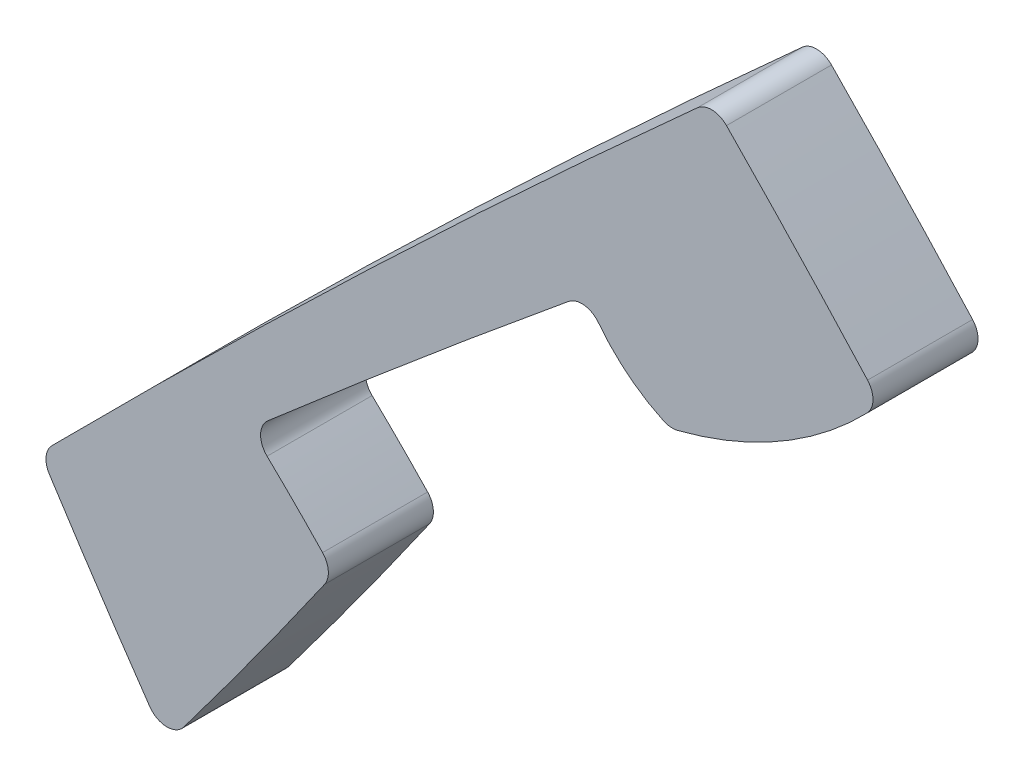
ISO-10303-21;
HEADER;
FILE_DESCRIPTION(('STEP AP214'),'2;1');
FILE_NAME('part.step','',(''),(''),'','','');
FILE_SCHEMA(('AUTOMOTIVE_DESIGN { 1 0 10303 214 1 1 1 1 }'));
ENDSEC;
DATA;
#1=APPLICATION_CONTEXT('core data for automotive mechanical design processes');
#2=APPLICATION_PROTOCOL_DEFINITION('international standard','automotive_design',2000,#1);
#3=PRODUCT_CONTEXT('',#1,'mechanical');
#4=PRODUCT('Part','Part','',(#3));
#5=PRODUCT_RELATED_PRODUCT_CATEGORY('part','',(#4));
#6=PRODUCT_DEFINITION_FORMATION('','',#4);
#7=PRODUCT_DEFINITION_CONTEXT('part definition',#1,'design');
#8=PRODUCT_DEFINITION('design','',#6,#7);
#9=PRODUCT_DEFINITION_SHAPE('','',#8);
#10=(LENGTH_UNIT() NAMED_UNIT(*) SI_UNIT(.MILLI.,.METRE.));
#11=(NAMED_UNIT(*) PLANE_ANGLE_UNIT() SI_UNIT($,.RADIAN.));
#12=(NAMED_UNIT(*) SI_UNIT($,.STERADIAN.) SOLID_ANGLE_UNIT());
#13=UNCERTAINTY_MEASURE_WITH_UNIT(LENGTH_MEASURE(1.E-05),#10,'distance_accuracy_value','');
#14=(GEOMETRIC_REPRESENTATION_CONTEXT(3) GLOBAL_UNCERTAINTY_ASSIGNED_CONTEXT((#13)) GLOBAL_UNIT_ASSIGNED_CONTEXT((#10,
#11,#12)) REPRESENTATION_CONTEXT('',''));
#15=CARTESIAN_POINT('',(0.,0.,0.));
#16=DIRECTION('',(0.,0.,1.));
#17=DIRECTION('',(1.,0.,0.));
#18=AXIS2_PLACEMENT_3D('',#15,#16,#17);
#19=CARTESIAN_POINT('',(-8.53649714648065,-8.33649714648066,1.));
#20=DIRECTION('',(0.,0.,-1.));
#21=DIRECTION('',(-1.,0.,0.));
#22=AXIS2_PLACEMENT_3D('',#19,#20,#21);
#23=CYLINDRICAL_SURFACE('',#22,15.4768840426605);
#24=CARTESIAN_POINT('',(-8.53649714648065,-8.33649714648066,0.));
#25=DIRECTION('',(0.,0.,1.));
#26=DIRECTION('',(1.,0.,0.));
#27=AXIS2_PLACEMENT_3D('',#24,#25,#26);
#28=CIRCLE('',#27,15.4768840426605);
#29=CARTESIAN_POINT('',(2.68839956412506,2.31881296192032,0.));
#30=VERTEX_POINT('',#29);
#31=CARTESIAN_POINT('',(2.15966447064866,2.849479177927,0.));
#32=VERTEX_POINT('',#31);
#33=EDGE_CURVE('E240',#30,#32,#28,.T.);
#34=ORIENTED_EDGE('',*,*,#33,.T.);
#35=DIRECTION('',(0.,0.,-1.));
#36=VECTOR('',#35,1.);
#37=CARTESIAN_POINT('',(2.15966447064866,2.849479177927,1.));
#38=LINE('',#37,#36);
#39=CARTESIAN_POINT('',(2.15966447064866,2.849479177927,1.));
#40=VERTEX_POINT('',#39);
#41=EDGE_CURVE('E228',#32,#40,#38,.F.);
#42=ORIENTED_EDGE('',*,*,#41,.T.);
#43=CARTESIAN_POINT('',(-8.53649714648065,-8.33649714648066,1.));
#44=DIRECTION('',(0.,0.,1.));
#45=DIRECTION('',(1.,0.,0.));
#46=AXIS2_PLACEMENT_3D('',#43,#44,#45);
#47=CIRCLE('',#46,15.4768840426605);
#48=CARTESIAN_POINT('',(2.68839956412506,2.31881296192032,1.));
#49=VERTEX_POINT('',#48);
#50=EDGE_CURVE('E175',#49,#40,#47,.T.);
#51=ORIENTED_EDGE('',*,*,#50,.F.);
#52=DIRECTION('',(0.,0.,-1.));
#53=VECTOR('',#52,1.);
#54=CARTESIAN_POINT('',(2.68839956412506,2.31881296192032,1.));
#55=LINE('',#54,#53);
#56=EDGE_CURVE('E225',#49,#30,#55,.T.);
#57=ORIENTED_EDGE('',*,*,#56,.T.);
#58=EDGE_LOOP('',(#34,#42,#51,#57));
#59=FACE_BOUND('',#58,.T.);
#60=ADVANCED_FACE('F33',(#59),#23,.T.);
#61=CARTESIAN_POINT('',(88.7337956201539,-96.5493133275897,1.));
#62=DIRECTION('',(0.,0.,-1.));
#63=DIRECTION('',(-1.,0.,0.));
#64=AXIS2_PLACEMENT_3D('',#61,#62,#63);
#65=CYLINDRICAL_SURFACE('',#64,132.033393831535);
#66=CARTESIAN_POINT('',(88.7337956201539,-96.5493133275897,0.));
#67=DIRECTION('',(0.,0.,-1.));
#68=DIRECTION('',(-1.,0.,0.));
#69=AXIS2_PLACEMENT_3D('',#66,#67,#68);
#70=CIRCLE('',#69,132.033393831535);
#71=CARTESIAN_POINT('',(2.16675658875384,3.14504378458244,0.));
#72=VERTEX_POINT('',#71);
#73=CARTESIAN_POINT('',(5.02993397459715,5.56082638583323,0.));
#74=VERTEX_POINT('',#73);
#75=EDGE_CURVE('E242',#72,#74,#70,.T.);
#76=ORIENTED_EDGE('',*,*,#75,.T.);
#77=DIRECTION('',(0.,0.,-1.));
#78=VECTOR('',#77,1.);
#79=CARTESIAN_POINT('',(5.02993397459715,5.56082638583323,1.));
#80=LINE('',#79,#78);
#81=CARTESIAN_POINT('',(5.02993397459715,5.56082638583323,1.));
#82=VERTEX_POINT('',#81);
#83=EDGE_CURVE('E223',#74,#82,#80,.F.);
#84=ORIENTED_EDGE('',*,*,#83,.T.);
#85=CARTESIAN_POINT('',(88.7337956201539,-96.5493133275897,1.));
#86=DIRECTION('',(0.,0.,-1.));
#87=DIRECTION('',(-1.,0.,0.));
#88=AXIS2_PLACEMENT_3D('',#85,#86,#87);
#89=CIRCLE('',#88,132.033393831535);
#90=CARTESIAN_POINT('',(2.16675658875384,3.14504378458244,1.));
#91=VERTEX_POINT('',#90);
#92=EDGE_CURVE('E257',#91,#82,#89,.T.);
#93=ORIENTED_EDGE('',*,*,#92,.F.);
#94=DIRECTION('',(0.,0.,-1.));
#95=VECTOR('',#94,1.);
#96=CARTESIAN_POINT('',(2.16675658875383,3.14504378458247,1.));
#97=LINE('',#96,#95);
#98=EDGE_CURVE('E220',#91,#72,#97,.T.);
#99=ORIENTED_EDGE('',*,*,#98,.T.);
#100=EDGE_LOOP('',(#76,#84,#93,#99));
#101=FACE_BOUND('',#100,.T.);
#102=ADVANCED_FACE('F260',(#101),#65,.F.);
#103=CARTESIAN_POINT('',(6.64481790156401,6.54407760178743,1.));
#104=DIRECTION('',(0.,0.,-1.));
#105=DIRECTION('',(-1.,0.,0.));
#106=AXIS2_PLACEMENT_3D('',#103,#104,#105);
#107=CYLINDRICAL_SURFACE('',#106,1.67330982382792);
#108=CARTESIAN_POINT('',(6.64481790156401,6.54407760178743,0.));
#109=DIRECTION('',(0.,0.,1.));
#110=DIRECTION('',(-1.,0.,0.));
#111=AXIS2_PLACEMENT_3D('',#108,#109,#110);
#112=CIRCLE('',#111,1.67330982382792);
#113=CARTESIAN_POINT('',(5.31559895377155,5.52764130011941,0.));
#114=VERTEX_POINT('',#113);
#115=CARTESIAN_POINT('',(5.93366944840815,5.02940481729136,0.));
#116=VERTEX_POINT('',#115);
#117=EDGE_CURVE('E279',#114,#116,#112,.T.);
#118=ORIENTED_EDGE('',*,*,#117,.T.);
#119=DIRECTION('',(0.,0.,-1.));
#120=VECTOR('',#119,1.);
#121=CARTESIAN_POINT('',(5.93366944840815,5.02940481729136,1.));
#122=LINE('',#121,#120);
#123=CARTESIAN_POINT('',(5.93366944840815,5.02940481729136,1.));
#124=VERTEX_POINT('',#123);
#125=EDGE_CURVE('E218',#116,#124,#122,.F.);
#126=ORIENTED_EDGE('',*,*,#125,.T.);
#127=CARTESIAN_POINT('',(6.64481790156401,6.54407760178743,1.));
#128=DIRECTION('',(0.,0.,1.));
#129=DIRECTION('',(-1.,0.,0.));
#130=AXIS2_PLACEMENT_3D('',#127,#128,#129);
#131=CIRCLE('',#130,1.67330982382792);
#132=CARTESIAN_POINT('',(5.31559895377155,5.52764130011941,1.));
#133=VERTEX_POINT('',#132);
#134=EDGE_CURVE('E262',#133,#124,#131,.T.);
#135=ORIENTED_EDGE('',*,*,#134,.F.);
#136=DIRECTION('',(0.,0.,-1.));
#137=VECTOR('',#136,1.);
#138=CARTESIAN_POINT('',(5.31559895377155,5.52764130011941,1.));
#139=LINE('',#138,#137);
#140=EDGE_CURVE('E215',#133,#114,#139,.T.);
#141=ORIENTED_EDGE('',*,*,#140,.T.);
#142=EDGE_LOOP('',(#118,#126,#135,#141));
#143=FACE_BOUND('',#142,.T.);
#144=ADVANCED_FACE('F313',(#143),#107,.T.);
#145=CARTESIAN_POINT('',(5.12569473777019,8.72384210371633,1.));
#146=DIRECTION('',(0.,0.,-1.));
#147=DIRECTION('',(-1.,0.,0.));
#148=AXIS2_PLACEMENT_3D('',#145,#146,#147);
#149=CYLINDRICAL_SURFACE('',#148,3.82510257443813);
#150=CARTESIAN_POINT('',(5.12569473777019,8.72384210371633,0.));
#151=DIRECTION('',(0.,0.,1.));
#152=DIRECTION('',(-1.,0.,0.));
#153=AXIS2_PLACEMENT_3D('',#150,#151,#152);
#154=CIRCLE('',#153,3.82510257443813);
#155=CARTESIAN_POINT('',(6.067934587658,5.01660677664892,0.));
#156=VERTEX_POINT('',#155);
#157=CARTESIAN_POINT('',(7.87293253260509,6.06224592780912,0.));
#158=VERTEX_POINT('',#157);
#159=EDGE_CURVE('E282',#156,#158,#154,.T.);
#160=ORIENTED_EDGE('',*,*,#159,.T.);
#161=DIRECTION('',(0.,0.,-1.));
#162=VECTOR('',#161,1.);
#163=CARTESIAN_POINT('',(7.87293253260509,6.06224592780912,1.));
#164=LINE('',#163,#162);
#165=CARTESIAN_POINT('',(7.87293253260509,6.06224592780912,1.));
#166=VERTEX_POINT('',#165);
#167=EDGE_CURVE('E213',#158,#166,#164,.F.);
#168=ORIENTED_EDGE('',*,*,#167,.T.);
#169=CARTESIAN_POINT('',(5.12569473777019,8.72384210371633,1.));
#170=DIRECTION('',(0.,0.,1.));
#171=DIRECTION('',(-1.,0.,0.));
#172=AXIS2_PLACEMENT_3D('',#169,#170,#171);
#173=CIRCLE('',#172,3.82510257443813);
#174=CARTESIAN_POINT('',(6.067934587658,5.01660677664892,1.));
#175=VERTEX_POINT('',#174);
#176=EDGE_CURVE('E265',#175,#166,#173,.T.);
#177=ORIENTED_EDGE('',*,*,#176,.F.);
#178=DIRECTION('',(0.,0.,-1.));
#179=VECTOR('',#178,1.);
#180=CARTESIAN_POINT('',(6.067934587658,5.01660677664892,1.));
#181=LINE('',#180,#179);
#182=EDGE_CURVE('E210',#175,#156,#181,.T.);
#183=ORIENTED_EDGE('',*,*,#182,.T.);
#184=EDGE_LOOP('',(#160,#168,#177,#183));
#185=FACE_BOUND('',#184,.T.);
#186=ADVANCED_FACE('F306',(#185),#149,.T.);
#187=CARTESIAN_POINT('',(-30.4827665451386,-28.4161332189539,1.));
#188=DIRECTION('',(0.,0.,-1.));
#189=DIRECTION('',(-1.,0.,0.));
#190=AXIS2_PLACEMENT_3D('',#187,#188,#189);
#191=CYLINDRICAL_SURFACE('',#190,51.7609891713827);
#192=CARTESIAN_POINT('',(-30.4827665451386,-28.4161332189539,0.));
#193=DIRECTION('',(0.,0.,1.));
#194=DIRECTION('',(1.,0.,0.));
#195=AXIS2_PLACEMENT_3D('',#192,#193,#194);
#196=CIRCLE('',#195,51.7609891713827);
#197=CARTESIAN_POINT('',(7.87751076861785,6.33568866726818,0.));
#198=VERTEX_POINT('',#197);
#199=CARTESIAN_POINT('',(6.53426023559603,7.76313886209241,0.));
#200=VERTEX_POINT('',#199);
#201=EDGE_CURVE('E177',#198,#200,#196,.T.);
#202=ORIENTED_EDGE('',*,*,#201,.T.);
#203=DIRECTION('',(0.,0.,-1.));
#204=VECTOR('',#203,1.);
#205=CARTESIAN_POINT('',(6.53426023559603,7.76313886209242,1.));
#206=LINE('',#205,#204);
#207=CARTESIAN_POINT('',(6.53426023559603,7.76313886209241,1.));
#208=VERTEX_POINT('',#207);
#209=EDGE_CURVE('E208',#200,#208,#206,.F.);
#210=ORIENTED_EDGE('',*,*,#209,.T.);
#211=CARTESIAN_POINT('',(-30.4827665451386,-28.4161332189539,1.));
#212=DIRECTION('',(0.,0.,1.));
#213=DIRECTION('',(1.,0.,0.));
#214=AXIS2_PLACEMENT_3D('',#211,#212,#213);
#215=CIRCLE('',#214,51.7609891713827);
#216=CARTESIAN_POINT('',(7.87751076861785,6.33568866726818,1.));
#217=VERTEX_POINT('',#216);
#218=EDGE_CURVE('E271',#217,#208,#215,.T.);
#219=ORIENTED_EDGE('',*,*,#218,.F.);
#220=DIRECTION('',(0.,0.,-1.));
#221=VECTOR('',#220,1.);
#222=CARTESIAN_POINT('',(7.87751076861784,6.33568866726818,1.));
#223=LINE('',#222,#221);
#224=EDGE_CURVE('E205',#217,#198,#223,.T.);
#225=ORIENTED_EDGE('',*,*,#224,.T.);
#226=EDGE_LOOP('',(#202,#210,#219,#225));
#227=FACE_BOUND('',#226,.T.);
#228=ADVANCED_FACE('F288',(#227),#191,.T.);
#229=CARTESIAN_POINT('',(103.318309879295,-100.192161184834,1.));
#230=DIRECTION('',(0.,0.,-1.));
#231=DIRECTION('',(-1.,0.,0.));
#232=AXIS2_PLACEMENT_3D('',#229,#230,#231);
#233=CYLINDRICAL_SURFACE('',#232,145.179454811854);
#234=CARTESIAN_POINT('',(103.318309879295,-100.192161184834,0.));
#235=DIRECTION('',(0.,0.,1.));
#236=DIRECTION('',(-1.,0.,0.));
#237=AXIS2_PLACEMENT_3D('',#234,#235,#236);
#238=CIRCLE('',#237,145.179454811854);
#239=CARTESIAN_POINT('',(6.257518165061,7.77207739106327,0.));
#240=VERTEX_POINT('',#239);
#241=CARTESIAN_POINT('',(0.11227192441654,1.91360666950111,0.));
#242=VERTEX_POINT('',#241);
#243=EDGE_CURVE('E173',#240,#242,#238,.T.);
#244=ORIENTED_EDGE('',*,*,#243,.T.);
#245=DIRECTION('',(0.,0.,-1.));
#246=VECTOR('',#245,1.);
#247=CARTESIAN_POINT('',(0.112271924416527,1.91360666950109,1.));
#248=LINE('',#247,#246);
#249=CARTESIAN_POINT('',(0.11227192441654,1.91360666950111,1.));
#250=VERTEX_POINT('',#249);
#251=EDGE_CURVE('E152',#242,#250,#248,.F.);
#252=ORIENTED_EDGE('',*,*,#251,.T.);
#253=CARTESIAN_POINT('',(103.318309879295,-100.192161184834,1.));
#254=DIRECTION('',(0.,0.,1.));
#255=DIRECTION('',(-1.,0.,0.));
#256=AXIS2_PLACEMENT_3D('',#253,#254,#255);
#257=CIRCLE('',#256,145.179454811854);
#258=CARTESIAN_POINT('',(6.257518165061,7.77207739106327,1.));
#259=VERTEX_POINT('',#258);
#260=EDGE_CURVE('E274',#259,#250,#257,.T.);
#261=ORIENTED_EDGE('',*,*,#260,.F.);
#262=DIRECTION('',(0.,0.,-1.));
#263=VECTOR('',#262,1.);
#264=CARTESIAN_POINT('',(6.25751816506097,7.77207739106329,1.));
#265=LINE('',#264,#263);
#266=EDGE_CURVE('E157',#259,#240,#265,.T.);
#267=ORIENTED_EDGE('',*,*,#266,.T.);
#268=EDGE_LOOP('',(#244,#252,#261,#267));
#269=FACE_BOUND('',#268,.T.);
#270=ADVANCED_FACE('F297',(#269),#233,.T.);
#271=CARTESIAN_POINT('',(41.5100903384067,28.1733935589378,1.));
#272=DIRECTION('',(0.,0.,-1.));
#273=DIRECTION('',(-1.,0.,0.));
#274=AXIS2_PLACEMENT_3D('',#271,#272,#273);
#275=CYLINDRICAL_SURFACE('',#274,49.1797060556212);
#276=CARTESIAN_POINT('',(41.5100903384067,28.1733935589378,1.));
#277=DIRECTION('',(0.,0.,1.));
#278=DIRECTION('',(-1.,0.,0.));
#279=AXIS2_PLACEMENT_3D('',#276,#277,#278);
#280=CIRCLE('',#279,49.1797060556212);
#281=CARTESIAN_POINT('',(0.0859889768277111,1.66514363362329,1.));
#282=VERTEX_POINT('',#281);
#283=CARTESIAN_POINT('',(1.04261136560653,0.226539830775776,1.));
#284=VERTEX_POINT('',#283);
#285=EDGE_CURVE('E166',#282,#284,#280,.T.);
#286=ORIENTED_EDGE('',*,*,#285,.F.);
#287=DIRECTION('',(0.,0.,-1.));
#288=VECTOR('',#287,1.);
#289=CARTESIAN_POINT('',(0.0859889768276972,1.66514363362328,1.));
#290=LINE('',#289,#288);
#291=CARTESIAN_POINT('',(0.0859889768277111,1.66514363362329,0.));
#292=VERTEX_POINT('',#291);
#293=EDGE_CURVE('E151',#282,#292,#290,.T.);
#294=ORIENTED_EDGE('',*,*,#293,.T.);
#295=CARTESIAN_POINT('',(41.5100903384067,28.1733935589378,0.));
#296=DIRECTION('',(0.,0.,1.));
#297=DIRECTION('',(-1.,0.,0.));
#298=AXIS2_PLACEMENT_3D('',#295,#296,#297);
#299=CIRCLE('',#298,49.1797060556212);
#300=CARTESIAN_POINT('',(1.04261136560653,0.226539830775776,0.));
#301=VERTEX_POINT('',#300);
#302=EDGE_CURVE('E164',#292,#301,#299,.T.);
#303=ORIENTED_EDGE('',*,*,#302,.T.);
#304=DIRECTION('',(0.,0.,-1.));
#305=VECTOR('',#304,1.);
#306=CARTESIAN_POINT('',(1.04261136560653,0.226539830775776,1.));
#307=LINE('',#306,#305);
#308=EDGE_CURVE('E168',#301,#284,#307,.F.);
#309=ORIENTED_EDGE('',*,*,#308,.T.);
#310=EDGE_LOOP('',(#286,#294,#303,#309));
#311=FACE_BOUND('',#310,.T.);
#312=ADVANCED_FACE('F163',(#311),#275,.T.);
#313=CARTESIAN_POINT('',(-45.9519434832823,35.9741407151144,1.));
#314=DIRECTION('',(0.,0.,-1.));
#315=DIRECTION('',(-1.,0.,0.));
#316=AXIS2_PLACEMENT_3D('',#313,#314,#315);
#317=CYLINDRICAL_SURFACE('',#316,59.3080481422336);
#318=CARTESIAN_POINT('',(-45.9519434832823,35.9741407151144,0.));
#319=DIRECTION('',(0.,0.,1.));
#320=DIRECTION('',(-1.,0.,0.));
#321=AXIS2_PLACEMENT_3D('',#318,#319,#320);
#322=CIRCLE('',#321,59.3080481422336);
#323=CARTESIAN_POINT('',(1.36675041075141,0.219619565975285,0.));
#324=VERTEX_POINT('',#323);
#325=CARTESIAN_POINT('',(2.70743616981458,2.06677652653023,0.));
#326=VERTEX_POINT('',#325);
#327=EDGE_CURVE('E172',#324,#326,#322,.T.);
#328=ORIENTED_EDGE('',*,*,#327,.T.);
#329=DIRECTION('',(0.,0.,-1.));
#330=VECTOR('',#329,1.);
#331=CARTESIAN_POINT('',(2.70743616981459,2.06677652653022,1.));
#332=LINE('',#331,#330);
#333=CARTESIAN_POINT('',(2.70743616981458,2.06677652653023,1.));
#334=VERTEX_POINT('',#333);
#335=EDGE_CURVE('E48',#326,#334,#332,.F.);
#336=ORIENTED_EDGE('',*,*,#335,.T.);
#337=CARTESIAN_POINT('',(-45.9519434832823,35.9741407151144,1.));
#338=DIRECTION('',(0.,0.,1.));
#339=DIRECTION('',(-1.,0.,0.));
#340=AXIS2_PLACEMENT_3D('',#337,#338,#339);
#341=CIRCLE('',#340,59.3080481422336);
#342=CARTESIAN_POINT('',(1.36675041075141,0.219619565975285,1.));
#343=VERTEX_POINT('',#342);
#344=EDGE_CURVE('E181',#343,#334,#341,.T.);
#345=ORIENTED_EDGE('',*,*,#344,.F.);
#346=DIRECTION('',(0.,0.,-1.));
#347=VECTOR('',#346,1.);
#348=CARTESIAN_POINT('',(1.36675041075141,0.219619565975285,1.));
#349=LINE('',#348,#347);
#350=EDGE_CURVE('E230',#343,#324,#349,.T.);
#351=ORIENTED_EDGE('',*,*,#350,.T.);
#352=EDGE_LOOP('',(#328,#336,#345,#351));
#353=FACE_BOUND('',#352,.T.);
#354=ADVANCED_FACE('F304',(#353),#317,.T.);
#355=CARTESIAN_POINT('',(40.0986492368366,-52.4429052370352,1.));
#356=DIRECTION('',(0.,0.,1.));
#357=DIRECTION('',(1.,0.,0.));
#358=AXIS2_PLACEMENT_3D('',#355,#356,#357);
#359=PLANE('',#358);
#360=ORIENTED_EDGE('',*,*,#260,.T.);
#361=CARTESIAN_POINT('',(0.254449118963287,1.77294521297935,1.));
#362=DIRECTION('',(0.,0.,1.));
#363=DIRECTION('',(1.,0.,0.));
#364=AXIS2_PLACEMENT_3D('',#361,#362,#363);
#365=CIRCLE('',#364,0.2);
#366=EDGE_CURVE('E203',#250,#282,#365,.T.);
#367=ORIENTED_EDGE('',*,*,#366,.T.);
#368=ORIENTED_EDGE('',*,*,#285,.T.);
#369=CARTESIAN_POINT('',(1.20718119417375,0.340191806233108,1.));
#370=DIRECTION('',(0.,0.,1.));
#371=DIRECTION('',(1.,0.,0.));
#372=AXIS2_PLACEMENT_3D('',#369,#370,#371);
#373=CIRCLE('',#372,0.2);
#374=EDGE_CURVE('E55',#284,#343,#373,.T.);
#375=ORIENTED_EDGE('',*,*,#374,.T.);
#376=ORIENTED_EDGE('',*,*,#344,.T.);
#377=CARTESIAN_POINT('',(2.54334586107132,2.18111974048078,1.));
#378=DIRECTION('',(0.,0.,1.));
#379=DIRECTION('',(1.,0.,0.));
#380=AXIS2_PLACEMENT_3D('',#377,#378,#379);
#381=CIRCLE('',#380,0.2);
#382=EDGE_CURVE('E195',#334,#49,#381,.T.);
#383=ORIENTED_EDGE('',*,*,#382,.T.);
#384=ORIENTED_EDGE('',*,*,#50,.T.);
#385=CARTESIAN_POINT('',(2.29788559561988,2.99402993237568,1.));
#386=DIRECTION('',(0.,0.,1.));
#387=DIRECTION('',(1.,0.,0.));
#388=AXIS2_PLACEMENT_3D('',#385,#386,#387);
#389=CIRCLE('',#388,0.2);
#390=EDGE_CURVE('E11',#40,#91,#389,.F.);
#391=ORIENTED_EDGE('',*,*,#390,.T.);
#392=ORIENTED_EDGE('',*,*,#92,.T.);
#393=CARTESIAN_POINT('',(5.15672593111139,5.40615318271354,1.));
#394=DIRECTION('',(0.,0.,1.));
#395=DIRECTION('',(1.,0.,0.));
#396=AXIS2_PLACEMENT_3D('',#393,#394,#395);
#397=CIRCLE('',#396,0.2);
#398=EDGE_CURVE('E236',#82,#133,#397,.F.);
#399=ORIENTED_EDGE('',*,*,#398,.T.);
#400=ORIENTED_EDGE('',*,*,#134,.T.);
#401=CARTESIAN_POINT('',(6.01866846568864,5.21044394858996,1.));
#402=DIRECTION('',(0.,0.,1.));
#403=DIRECTION('',(1.,0.,0.));
#404=AXIS2_PLACEMENT_3D('',#401,#402,#403);
#405=CIRCLE('',#404,0.2);
#406=EDGE_CURVE('E197',#124,#175,#405,.T.);
#407=ORIENTED_EDGE('',*,*,#406,.T.);
#408=ORIENTED_EDGE('',*,*,#176,.T.);
#409=CARTESIAN_POINT('',(7.7292899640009,6.2014106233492,1.));
#410=DIRECTION('',(0.,0.,1.));
#411=DIRECTION('',(1.,0.,0.));
#412=AXIS2_PLACEMENT_3D('',#409,#410,#411);
#413=CIRCLE('',#412,0.2);
#414=EDGE_CURVE('E199',#166,#217,#413,.T.);
#415=ORIENTED_EDGE('',*,*,#414,.T.);
#416=ORIENTED_EDGE('',*,*,#218,.T.);
#417=CARTESIAN_POINT('',(6.39122963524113,7.62334527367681,1.));
#418=DIRECTION('',(0.,0.,1.));
#419=DIRECTION('',(1.,0.,0.));
#420=AXIS2_PLACEMENT_3D('',#417,#418,#419);
#421=CIRCLE('',#420,0.2);
#422=EDGE_CURVE('E201',#208,#259,#421,.T.);
#423=ORIENTED_EDGE('',*,*,#422,.T.);
#424=EDGE_LOOP('',(#360,#367,#368,#375,#376,#383,#384,#391,#392,#399,#400,#407,#408,#415,#416,#423));
#425=FACE_BOUND('',#424,.T.);
#426=ADVANCED_FACE('F256',(#425),#359,.T.);
#427=CARTESIAN_POINT('',(40.0986492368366,-52.4429052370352,0.));
#428=DIRECTION('',(0.,0.,1.));
#429=DIRECTION('',(1.,0.,0.));
#430=AXIS2_PLACEMENT_3D('',#427,#428,#429);
#431=PLANE('',#430);
#432=ORIENTED_EDGE('',*,*,#302,.F.);
#433=CARTESIAN_POINT('',(0.254449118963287,1.77294521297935,0.));
#434=DIRECTION('',(0.,0.,1.));
#435=DIRECTION('',(1.,0.,0.));
#436=AXIS2_PLACEMENT_3D('',#433,#434,#435);
#437=CIRCLE('',#436,0.2);
#438=EDGE_CURVE('E147',#292,#242,#437,.F.);
#439=ORIENTED_EDGE('',*,*,#438,.T.);
#440=ORIENTED_EDGE('',*,*,#243,.F.);
#441=CARTESIAN_POINT('',(6.39122963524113,7.62334527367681,0.));
#442=DIRECTION('',(0.,0.,1.));
#443=DIRECTION('',(1.,0.,0.));
#444=AXIS2_PLACEMENT_3D('',#441,#442,#443);
#445=CIRCLE('',#444,0.2);
#446=EDGE_CURVE('E158',#240,#200,#445,.F.);
#447=ORIENTED_EDGE('',*,*,#446,.T.);
#448=ORIENTED_EDGE('',*,*,#201,.F.);
#449=CARTESIAN_POINT('',(7.7292899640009,6.2014106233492,0.));
#450=DIRECTION('',(0.,0.,1.));
#451=DIRECTION('',(1.,0.,0.));
#452=AXIS2_PLACEMENT_3D('',#449,#450,#451);
#453=CIRCLE('',#452,0.2);
#454=EDGE_CURVE('E188',#198,#158,#453,.F.);
#455=ORIENTED_EDGE('',*,*,#454,.T.);
#456=ORIENTED_EDGE('',*,*,#159,.F.);
#457=CARTESIAN_POINT('',(6.01866846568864,5.21044394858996,0.));
#458=DIRECTION('',(0.,0.,1.));
#459=DIRECTION('',(1.,0.,0.));
#460=AXIS2_PLACEMENT_3D('',#457,#458,#459);
#461=CIRCLE('',#460,0.2);
#462=EDGE_CURVE('E186',#156,#116,#461,.F.);
#463=ORIENTED_EDGE('',*,*,#462,.T.);
#464=ORIENTED_EDGE('',*,*,#117,.F.);
#465=CARTESIAN_POINT('',(5.15672593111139,5.40615318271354,0.));
#466=DIRECTION('',(0.,0.,1.));
#467=DIRECTION('',(1.,0.,0.));
#468=AXIS2_PLACEMENT_3D('',#465,#466,#467);
#469=CIRCLE('',#468,0.2);
#470=EDGE_CURVE('E234',#114,#74,#469,.T.);
#471=ORIENTED_EDGE('',*,*,#470,.T.);
#472=ORIENTED_EDGE('',*,*,#75,.F.);
#473=CARTESIAN_POINT('',(2.29788559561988,2.99402993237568,0.));
#474=DIRECTION('',(0.,0.,1.));
#475=DIRECTION('',(1.,0.,0.));
#476=AXIS2_PLACEMENT_3D('',#473,#474,#475);
#477=CIRCLE('',#476,0.2);
#478=EDGE_CURVE('E41',#72,#32,#477,.T.);
#479=ORIENTED_EDGE('',*,*,#478,.T.);
#480=ORIENTED_EDGE('',*,*,#33,.F.);
#481=CARTESIAN_POINT('',(2.54334586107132,2.18111974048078,0.));
#482=DIRECTION('',(0.,0.,1.));
#483=DIRECTION('',(1.,0.,0.));
#484=AXIS2_PLACEMENT_3D('',#481,#482,#483);
#485=CIRCLE('',#484,0.2);
#486=EDGE_CURVE('E184',#30,#326,#485,.F.);
#487=ORIENTED_EDGE('',*,*,#486,.T.);
#488=ORIENTED_EDGE('',*,*,#327,.F.);
#489=CARTESIAN_POINT('',(1.20718119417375,0.340191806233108,0.));
#490=DIRECTION('',(0.,0.,1.));
#491=DIRECTION('',(1.,0.,0.));
#492=AXIS2_PLACEMENT_3D('',#489,#490,#491);
#493=CIRCLE('',#492,0.2);
#494=EDGE_CURVE('E167',#324,#301,#493,.F.);
#495=ORIENTED_EDGE('',*,*,#494,.T.);
#496=EDGE_LOOP('',(#432,#439,#440,#447,#448,#455,#456,#463,#464,#471,#472,#479,#480,#487,#488,#495));
#497=FACE_BOUND('',#496,.T.);
#498=ADVANCED_FACE('F170',(#497),#431,.F.);
#499=CARTESIAN_POINT('',(0.254449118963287,1.77294521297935,1.));
#500=DIRECTION('',(0.,0.,-1.));
#501=DIRECTION('',(-1.,0.,0.));
#502=AXIS2_PLACEMENT_3D('',#499,#500,#501);
#503=CYLINDRICAL_SURFACE('',#502,0.2);
#504=ORIENTED_EDGE('',*,*,#366,.F.);
#505=ORIENTED_EDGE('',*,*,#251,.F.);
#506=ORIENTED_EDGE('',*,*,#438,.F.);
#507=ORIENTED_EDGE('',*,*,#293,.F.);
#508=EDGE_LOOP('',(#504,#505,#506,#507));
#509=FACE_BOUND('',#508,.T.);
#510=ADVANCED_FACE('F150',(#509),#503,.T.);
#511=CARTESIAN_POINT('',(6.39122963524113,7.62334527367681,1.));
#512=DIRECTION('',(0.,0.,-1.));
#513=DIRECTION('',(-1.,0.,0.));
#514=AXIS2_PLACEMENT_3D('',#511,#512,#513);
#515=CYLINDRICAL_SURFACE('',#514,0.2);
#516=ORIENTED_EDGE('',*,*,#422,.F.);
#517=ORIENTED_EDGE('',*,*,#209,.F.);
#518=ORIENTED_EDGE('',*,*,#446,.F.);
#519=ORIENTED_EDGE('',*,*,#266,.F.);
#520=EDGE_LOOP('',(#516,#517,#518,#519));
#521=FACE_BOUND('',#520,.T.);
#522=ADVANCED_FACE('F293',(#521),#515,.T.);
#523=CARTESIAN_POINT('',(7.7292899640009,6.2014106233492,1.));
#524=DIRECTION('',(0.,0.,-1.));
#525=DIRECTION('',(-1.,0.,0.));
#526=AXIS2_PLACEMENT_3D('',#523,#524,#525);
#527=CYLINDRICAL_SURFACE('',#526,0.2);
#528=ORIENTED_EDGE('',*,*,#414,.F.);
#529=ORIENTED_EDGE('',*,*,#167,.F.);
#530=ORIENTED_EDGE('',*,*,#454,.F.);
#531=ORIENTED_EDGE('',*,*,#224,.F.);
#532=EDGE_LOOP('',(#528,#529,#530,#531));
#533=FACE_BOUND('',#532,.T.);
#534=ADVANCED_FACE('F321',(#533),#527,.T.);
#535=CARTESIAN_POINT('',(6.01866846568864,5.21044394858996,1.));
#536=DIRECTION('',(0.,0.,-1.));
#537=DIRECTION('',(-1.,0.,0.));
#538=AXIS2_PLACEMENT_3D('',#535,#536,#537);
#539=CYLINDRICAL_SURFACE('',#538,0.2);
#540=ORIENTED_EDGE('',*,*,#406,.F.);
#541=ORIENTED_EDGE('',*,*,#125,.F.);
#542=ORIENTED_EDGE('',*,*,#462,.F.);
#543=ORIENTED_EDGE('',*,*,#182,.F.);
#544=EDGE_LOOP('',(#540,#541,#542,#543));
#545=FACE_BOUND('',#544,.T.);
#546=ADVANCED_FACE('F324',(#545),#539,.T.);
#547=CARTESIAN_POINT('',(5.15672593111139,5.40615318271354,1.));
#548=DIRECTION('',(0.,0.,-1.));
#549=DIRECTION('',(-1.,0.,0.));
#550=AXIS2_PLACEMENT_3D('',#547,#548,#549);
#551=CYLINDRICAL_SURFACE('',#550,0.2);
#552=ORIENTED_EDGE('',*,*,#398,.F.);
#553=ORIENTED_EDGE('',*,*,#83,.F.);
#554=ORIENTED_EDGE('',*,*,#470,.F.);
#555=ORIENTED_EDGE('',*,*,#140,.F.);
#556=EDGE_LOOP('',(#552,#553,#554,#555));
#557=FACE_BOUND('',#556,.T.);
#558=ADVANCED_FACE('F328',(#557),#551,.F.);
#559=CARTESIAN_POINT('',(2.29788559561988,2.99402993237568,1.));
#560=DIRECTION('',(0.,0.,-1.));
#561=DIRECTION('',(-1.,0.,0.));
#562=AXIS2_PLACEMENT_3D('',#559,#560,#561);
#563=CYLINDRICAL_SURFACE('',#562,0.2);
#564=ORIENTED_EDGE('',*,*,#390,.F.);
#565=ORIENTED_EDGE('',*,*,#41,.F.);
#566=ORIENTED_EDGE('',*,*,#478,.F.);
#567=ORIENTED_EDGE('',*,*,#98,.F.);
#568=EDGE_LOOP('',(#564,#565,#566,#567));
#569=FACE_BOUND('',#568,.T.);
#570=ADVANCED_FACE('F252',(#569),#563,.F.);
#571=CARTESIAN_POINT('',(2.54334586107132,2.18111974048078,1.));
#572=DIRECTION('',(0.,0.,-1.));
#573=DIRECTION('',(-1.,0.,0.));
#574=AXIS2_PLACEMENT_3D('',#571,#572,#573);
#575=CYLINDRICAL_SURFACE('',#574,0.2);
#576=ORIENTED_EDGE('',*,*,#382,.F.);
#577=ORIENTED_EDGE('',*,*,#335,.F.);
#578=ORIENTED_EDGE('',*,*,#486,.F.);
#579=ORIENTED_EDGE('',*,*,#56,.F.);
#580=EDGE_LOOP('',(#576,#577,#578,#579));
#581=FACE_BOUND('',#580,.T.);
#582=ADVANCED_FACE('F334',(#581),#575,.T.);
#583=CARTESIAN_POINT('',(1.20718119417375,0.340191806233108,1.));
#584=DIRECTION('',(0.,0.,-1.));
#585=DIRECTION('',(-1.,0.,0.));
#586=AXIS2_PLACEMENT_3D('',#583,#584,#585);
#587=CYLINDRICAL_SURFACE('',#586,0.2);
#588=ORIENTED_EDGE('',*,*,#374,.F.);
#589=ORIENTED_EDGE('',*,*,#308,.F.);
#590=ORIENTED_EDGE('',*,*,#494,.F.);
#591=ORIENTED_EDGE('',*,*,#350,.F.);
#592=EDGE_LOOP('',(#588,#589,#590,#591));
#593=FACE_BOUND('',#592,.T.);
#594=ADVANCED_FACE('F35',(#593),#587,.T.);
#595=CLOSED_SHELL('',(#60,#102,#144,#186,#228,#270,#312,#354,#426,#498,#510,#522,#534,#546,#558,
#570,#582,#594));
#596=MANIFOLD_SOLID_BREP('B2',#595);
#597=ADVANCED_BREP_SHAPE_REPRESENTATION('',(#18,#596),#14);
#598=SHAPE_DEFINITION_REPRESENTATION(#9,#597);
ENDSEC;
END-ISO-10303-21;
